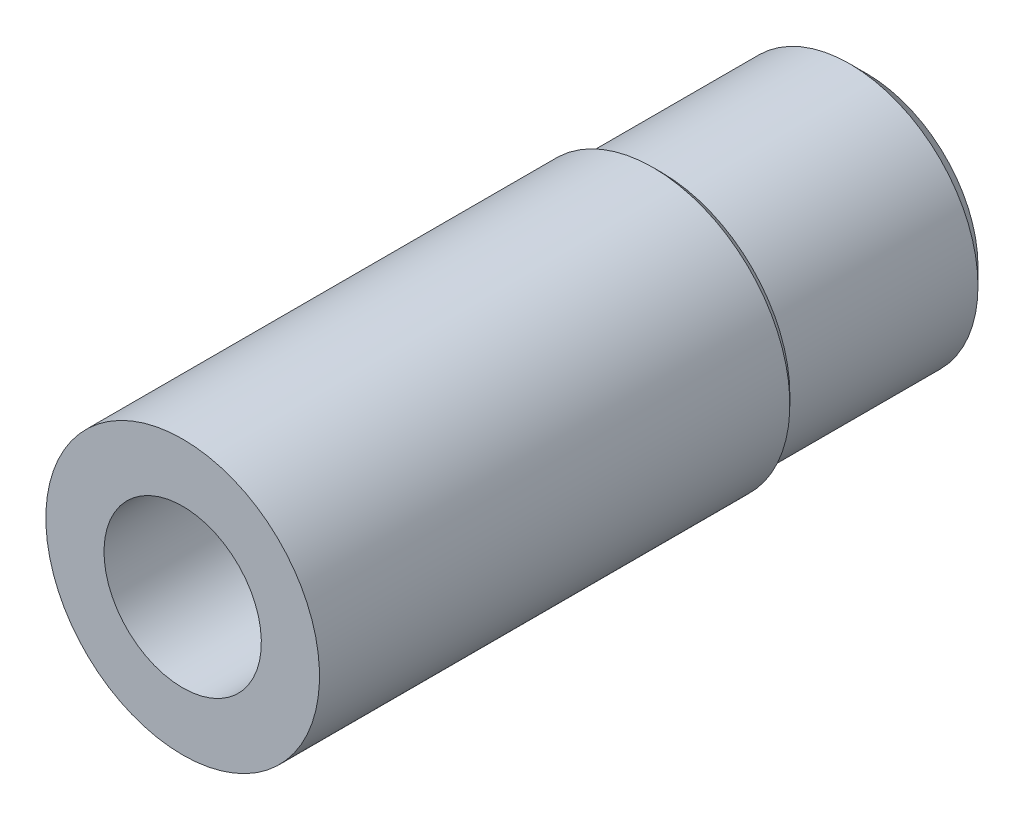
ISO-10303-21;
HEADER;
FILE_DESCRIPTION(('STEP AP214'),'2;1');
FILE_NAME('part.step','',(''),(''),'','','');
FILE_SCHEMA(('AUTOMOTIVE_DESIGN { 1 0 10303 214 1 1 1 1 }'));
ENDSEC;
DATA;
#1=APPLICATION_CONTEXT('core data for automotive mechanical design processes');
#2=APPLICATION_PROTOCOL_DEFINITION('international standard','automotive_design',2000,#1);
#3=PRODUCT_CONTEXT('',#1,'mechanical');
#4=PRODUCT('Part','Part','',(#3));
#5=PRODUCT_RELATED_PRODUCT_CATEGORY('part','',(#4));
#6=PRODUCT_DEFINITION_FORMATION('','',#4);
#7=PRODUCT_DEFINITION_CONTEXT('part definition',#1,'design');
#8=PRODUCT_DEFINITION('design','',#6,#7);
#9=PRODUCT_DEFINITION_SHAPE('','',#8);
#10=(LENGTH_UNIT() NAMED_UNIT(*) SI_UNIT(.MILLI.,.METRE.));
#11=(NAMED_UNIT(*) PLANE_ANGLE_UNIT() SI_UNIT($,.RADIAN.));
#12=(NAMED_UNIT(*) SI_UNIT($,.STERADIAN.) SOLID_ANGLE_UNIT());
#13=UNCERTAINTY_MEASURE_WITH_UNIT(LENGTH_MEASURE(1.E-05),#10,'distance_accuracy_value','');
#14=(GEOMETRIC_REPRESENTATION_CONTEXT(3) GLOBAL_UNCERTAINTY_ASSIGNED_CONTEXT((#13)) GLOBAL_UNIT_ASSIGNED_CONTEXT((#10,
#11,#12)) REPRESENTATION_CONTEXT('',''));
#15=CARTESIAN_POINT('',(0.,0.,0.));
#16=DIRECTION('',(0.,0.,1.));
#17=DIRECTION('',(1.,0.,0.));
#18=AXIS2_PLACEMENT_3D('',#15,#16,#17);
#19=CARTESIAN_POINT('',(1.50000000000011,0.,-14.));
#20=DIRECTION('',(0.,0.,-1.));
#21=DIRECTION('',(-1.,0.,0.));
#22=AXIS2_PLACEMENT_3D('',#19,#20,#21);
#23=PLANE('',#22);
#24=CARTESIAN_POINT('',(0.,0.,-14.));
#25=DIRECTION('',(0.,0.,1.));
#26=DIRECTION('',(0.,-1.,0.));
#27=AXIS2_PLACEMENT_3D('',#24,#25,#26);
#28=CIRCLE('',#27,1.25000000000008);
#29=CARTESIAN_POINT('',(0.,-1.25000000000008,-14.));
#30=VERTEX_POINT('',#29);
#31=EDGE_CURVE('E54',#30,#30,#28,.T.);
#32=ORIENTED_EDGE('',*,*,#31,.T.);
#33=EDGE_LOOP('',(#32));
#34=FACE_BOUND('',#33,.T.);
#35=CARTESIAN_POINT('',(0.,0.,-14.));
#36=DIRECTION('',(0.,0.,1.));
#37=DIRECTION('',(0.,-1.,0.));
#38=AXIS2_PLACEMENT_3D('',#35,#36,#37);
#39=CIRCLE('',#38,1.75000000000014);
#40=CARTESIAN_POINT('',(0.,-1.75000000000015,-14.));
#41=VERTEX_POINT('',#40);
#42=EDGE_CURVE('E17',#41,#41,#39,.F.);
#43=ORIENTED_EDGE('',*,*,#42,.T.);
#44=EDGE_LOOP('',(#43));
#45=FACE_BOUND('',#44,.T.);
#46=ADVANCED_FACE('F14',(#34,#45),#23,.T.);
#47=CARTESIAN_POINT('',(0.,0.,-20.));
#48=DIRECTION('',(0.,0.,1.));
#49=DIRECTION('',(0.,-1.,0.));
#50=AXIS2_PLACEMENT_3D('',#47,#48,#49);
#51=CYLINDRICAL_SURFACE('',#50,1.75000000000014);
#52=ORIENTED_EDGE('',*,*,#42,.F.);
#53=EDGE_LOOP('',(#52));
#54=FACE_BOUND('',#53,.T.);
#55=CARTESIAN_POINT('',(0.,0.,-20.));
#56=DIRECTION('',(0.,0.,1.));
#57=DIRECTION('',(0.,-1.,0.));
#58=AXIS2_PLACEMENT_3D('',#55,#56,#57);
#59=CIRCLE('',#58,1.75000000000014);
#60=CARTESIAN_POINT('',(0.,-1.75000000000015,-20.));
#61=VERTEX_POINT('',#60);
#62=EDGE_CURVE('E52',#61,#61,#59,.T.);
#63=ORIENTED_EDGE('',*,*,#62,.F.);
#64=EDGE_LOOP('',(#63));
#65=FACE_BOUND('',#64,.T.);
#66=ADVANCED_FACE('F62',(#54,#65),#51,.F.);
#67=CARTESIAN_POINT('',(0.,0.,-14.));
#68=DIRECTION('',(0.,0.,1.));
#69=DIRECTION('',(0.,-1.,0.));
#70=AXIS2_PLACEMENT_3D('',#67,#68,#69);
#71=CYLINDRICAL_SURFACE('',#70,1.25000000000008);
#72=CARTESIAN_POINT('',(0.,0.,-10.8870967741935));
#73=DIRECTION('',(0.,0.,1.));
#74=DIRECTION('',(0.,-1.,0.));
#75=AXIS2_PLACEMENT_3D('',#72,#73,#74);
#76=CIRCLE('',#75,1.25000000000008);
#77=CARTESIAN_POINT('',(0.,-1.25000000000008,-10.8870967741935));
#78=VERTEX_POINT('',#77);
#79=EDGE_CURVE('E49',#78,#78,#76,.F.);
#80=ORIENTED_EDGE('',*,*,#79,.F.);
#81=EDGE_LOOP('',(#80));
#82=FACE_BOUND('',#81,.T.);
#83=ORIENTED_EDGE('',*,*,#31,.F.);
#84=EDGE_LOOP('',(#83));
#85=FACE_BOUND('',#84,.T.);
#86=ADVANCED_FACE('F65',(#82,#85),#71,.F.);
#87=CARTESIAN_POINT('',(2.50000000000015,0.,-20.));
#88=DIRECTION('',(0.,0.,-1.));
#89=DIRECTION('',(-1.,0.,0.));
#90=AXIS2_PLACEMENT_3D('',#87,#88,#89);
#91=PLANE('',#90);
#92=ORIENTED_EDGE('',*,*,#62,.T.);
#93=EDGE_LOOP('',(#92));
#94=FACE_BOUND('',#93,.T.);
#95=CARTESIAN_POINT('',(0.,0.,-20.0000008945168));
#96=DIRECTION('',(0.,0.,1.));
#97=DIRECTION('',(1.,0.,0.));
#98=AXIS2_PLACEMENT_3D('',#95,#96,#97);
#99=CIRCLE('',#98,3.25000089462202);
#100=CARTESIAN_POINT('',(3.25000089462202,0.,-20.0000008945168));
#101=VERTEX_POINT('',#100);
#102=EDGE_CURVE('E46',#101,#101,#99,.T.);
#103=ORIENTED_EDGE('',*,*,#102,.F.);
#104=EDGE_LOOP('',(#103));
#105=FACE_BOUND('',#104,.T.);
#106=ADVANCED_FACE('F68',(#94,#105),#91,.T.);
#107=CARTESIAN_POINT('',(1.77500000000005,0.,-10.8870967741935));
#108=DIRECTION('',(0.,0.,1.));
#109=DIRECTION('',(1.,0.,0.));
#110=AXIS2_PLACEMENT_3D('',#107,#108,#109);
#111=PLANE('',#110);
#112=ORIENTED_EDGE('',*,*,#79,.T.);
#113=EDGE_LOOP('',(#112));
#114=FACE_BOUND('',#113,.T.);
#115=CARTESIAN_POINT('',(0.,0.,-10.8870967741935));
#116=DIRECTION('',(0.,0.,1.));
#117=DIRECTION('',(0.,-1.,0.));
#118=AXIS2_PLACEMENT_3D('',#115,#116,#117);
#119=CIRCLE('',#118,2.3);
#120=CARTESIAN_POINT('',(0.,-2.3,-10.8870967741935));
#121=VERTEX_POINT('',#120);
#122=EDGE_CURVE('E39',#121,#121,#119,.T.);
#123=ORIENTED_EDGE('',*,*,#122,.T.);
#124=EDGE_LOOP('',(#123));
#125=FACE_BOUND('',#124,.T.);
#126=ADVANCED_FACE('F71',(#114,#125),#111,.T.);
#127=CARTESIAN_POINT('',(0.,0.,-19.5000008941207));
#128=DIRECTION('',(0.,0.,1.));
#129=DIRECTION('',(1.,0.,0.));
#130=AXIS2_PLACEMENT_3D('',#127,#128,#129);
#131=CONICAL_SURFACE('',#130,3.7500008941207,0.785398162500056);
#132=ORIENTED_EDGE('',*,*,#102,.T.);
#133=EDGE_LOOP('',(#132));
#134=FACE_BOUND('',#133,.T.);
#135=CARTESIAN_POINT('',(0.,0.,-19.5));
#136=DIRECTION('',(0.,0.,1.));
#137=DIRECTION('',(0.,-1.,0.));
#138=AXIS2_PLACEMENT_3D('',#135,#136,#137);
#139=CIRCLE('',#138,3.75000000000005);
#140=CARTESIAN_POINT('',(0.,-3.75000000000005,-19.5));
#141=VERTEX_POINT('',#140);
#142=EDGE_CURVE('E36',#141,#141,#139,.T.);
#143=ORIENTED_EDGE('',*,*,#142,.F.);
#144=EDGE_LOOP('',(#143));
#145=FACE_BOUND('',#144,.T.);
#146=ADVANCED_FACE('F75',(#134,#145),#131,.T.);
#147=CARTESIAN_POINT('',(0.,0.,-10.8870967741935));
#148=DIRECTION('',(0.,0.,1.));
#149=DIRECTION('',(0.,-1.,0.));
#150=AXIS2_PLACEMENT_3D('',#147,#148,#149);
#151=CYLINDRICAL_SURFACE('',#150,2.3);
#152=CARTESIAN_POINT('',(0.,0.,0.));
#153=DIRECTION('',(0.,0.,1.));
#154=DIRECTION('',(0.,-1.,0.));
#155=AXIS2_PLACEMENT_3D('',#152,#153,#154);
#156=CIRCLE('',#155,2.3);
#157=CARTESIAN_POINT('',(0.,-2.3,0.));
#158=VERTEX_POINT('',#157);
#159=EDGE_CURVE('E33',#158,#158,#156,.F.);
#160=ORIENTED_EDGE('',*,*,#159,.F.);
#161=EDGE_LOOP('',(#160));
#162=FACE_BOUND('',#161,.T.);
#163=ORIENTED_EDGE('',*,*,#122,.F.);
#164=EDGE_LOOP('',(#163));
#165=FACE_BOUND('',#164,.T.);
#166=ADVANCED_FACE('F78',(#162,#165),#151,.F.);
#167=CARTESIAN_POINT('',(0.,0.,-19.5));
#168=DIRECTION('',(0.,0.,1.));
#169=DIRECTION('',(0.,-1.,0.));
#170=AXIS2_PLACEMENT_3D('',#167,#168,#169);
#171=CYLINDRICAL_SURFACE('',#170,3.75000000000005);
#172=ORIENTED_EDGE('',*,*,#142,.T.);
#173=EDGE_LOOP('',(#172));
#174=FACE_BOUND('',#173,.T.);
#175=CARTESIAN_POINT('',(0.,0.,-14.000000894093));
#176=DIRECTION('',(0.,0.,1.));
#177=DIRECTION('',(0.,-1.,0.));
#178=AXIS2_PLACEMENT_3D('',#175,#176,#177);
#179=CIRCLE('',#178,3.75000089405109);
#180=CARTESIAN_POINT('',(0.,-3.75000089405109,-14.000000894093));
#181=VERTEX_POINT('',#180);
#182=EDGE_CURVE('E26',#181,#181,#179,.T.);
#183=ORIENTED_EDGE('',*,*,#182,.F.);
#184=EDGE_LOOP('',(#183));
#185=FACE_BOUND('',#184,.T.);
#186=ADVANCED_FACE('F82',(#174,#185),#171,.T.);
#187=CARTESIAN_POINT('',(3.1000000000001,0.,0.));
#188=DIRECTION('',(0.,0.,1.));
#189=DIRECTION('',(1.,0.,0.));
#190=AXIS2_PLACEMENT_3D('',#187,#188,#189);
#191=PLANE('',#190);
#192=CARTESIAN_POINT('',(0.,0.,0.));
#193=DIRECTION('',(0.,0.,1.));
#194=DIRECTION('',(0.,-1.,0.));
#195=AXIS2_PLACEMENT_3D('',#192,#193,#194);
#196=CIRCLE('',#195,4.00000000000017);
#197=CARTESIAN_POINT('',(0.,-4.00000000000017,0.));
#198=VERTEX_POINT('',#197);
#199=EDGE_CURVE('E21',#198,#198,#196,.F.);
#200=ORIENTED_EDGE('',*,*,#199,.F.);
#201=EDGE_LOOP('',(#200));
#202=FACE_BOUND('',#201,.T.);
#203=ORIENTED_EDGE('',*,*,#159,.T.);
#204=EDGE_LOOP('',(#203));
#205=FACE_BOUND('',#204,.T.);
#206=ADVANCED_FACE('F85',(#202,#205),#191,.T.);
#207=CARTESIAN_POINT('',(0.,0.,-13.7500008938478));
#208=DIRECTION('',(0.,0.,1.));
#209=DIRECTION('',(1.,0.,0.));
#210=AXIS2_PLACEMENT_3D('',#207,#208,#209);
#211=CONICAL_SURFACE('',#210,4.00000089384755,0.785398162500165);
#212=ORIENTED_EDGE('',*,*,#182,.T.);
#213=EDGE_LOOP('',(#212));
#214=FACE_BOUND('',#213,.T.);
#215=CARTESIAN_POINT('',(0.,0.,-13.75));
#216=DIRECTION('',(0.,0.,1.));
#217=DIRECTION('',(0.,-1.,0.));
#218=AXIS2_PLACEMENT_3D('',#215,#216,#217);
#219=CIRCLE('',#218,4.00000000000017);
#220=CARTESIAN_POINT('',(0.,-4.00000000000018,-13.75));
#221=VERTEX_POINT('',#220);
#222=EDGE_CURVE('E9',#221,#221,#219,.T.);
#223=ORIENTED_EDGE('',*,*,#222,.F.);
#224=EDGE_LOOP('',(#223));
#225=FACE_BOUND('',#224,.T.);
#226=ADVANCED_FACE('F89',(#214,#225),#211,.T.);
#227=CARTESIAN_POINT('',(0.,0.,-13.75));
#228=DIRECTION('',(0.,0.,1.));
#229=DIRECTION('',(0.,-1.,0.));
#230=AXIS2_PLACEMENT_3D('',#227,#228,#229);
#231=CYLINDRICAL_SURFACE('',#230,4.00000000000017);
#232=ORIENTED_EDGE('',*,*,#222,.T.);
#233=EDGE_LOOP('',(#232));
#234=FACE_BOUND('',#233,.T.);
#235=ORIENTED_EDGE('',*,*,#199,.T.);
#236=EDGE_LOOP('',(#235));
#237=FACE_BOUND('',#236,.T.);
#238=ADVANCED_FACE('F92',(#234,#237),#231,.T.);
#239=CLOSED_SHELL('',(#46,#66,#86,#106,#126,#146,#166,#186,#206,#226,#238));
#240=MANIFOLD_SOLID_BREP('B1',#239);
#241=ADVANCED_BREP_SHAPE_REPRESENTATION('',(#18,#240),#14);
#242=SHAPE_DEFINITION_REPRESENTATION(#9,#241);
ENDSEC;
END-ISO-10303-21;
